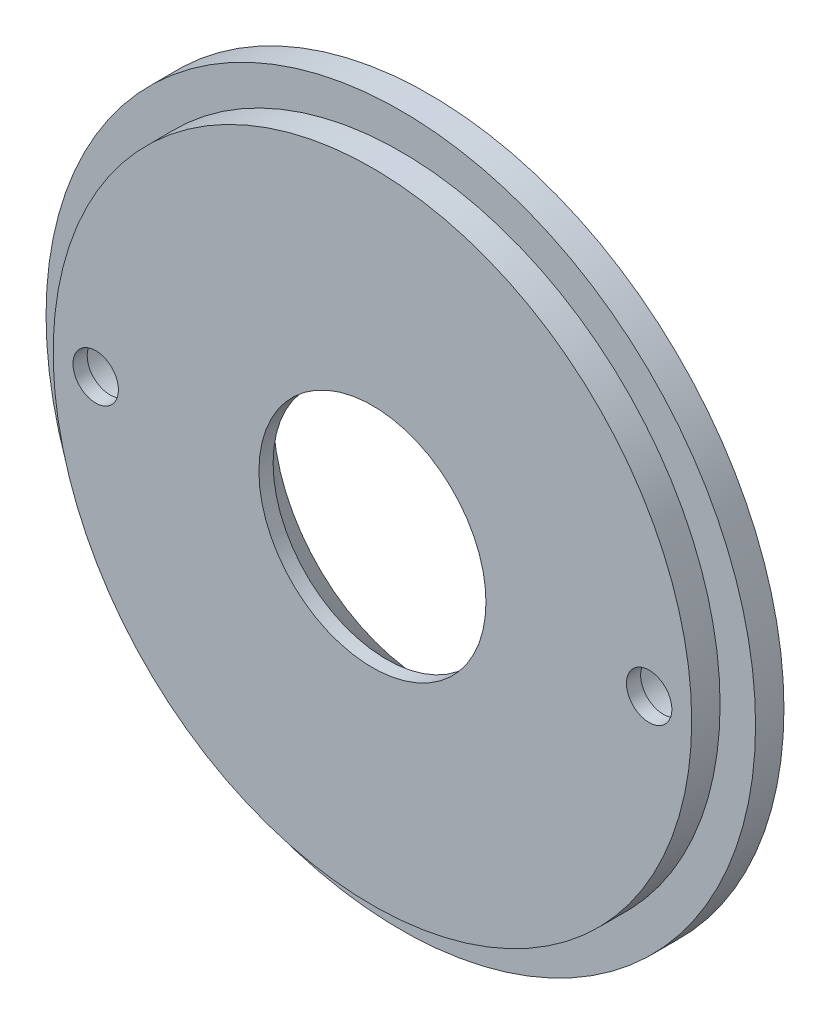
from build123d import *

# Parameters (mm, degrees)
ESQUISSE1_R                                     = 45
BASE_EXTRUSION_DEPTH                            = 4
ESQUISSE2_R                                     = 50
BOSS_EXTRU_1_DEPTH                              = 4
ESQUISSE3_R                                     = 16
ENL_V_MAT_EXTRU_1_DEPTH                         = 14
CHAMBRAGE_POUR_VIS_T_TE_CYLINDRIQUE_D           = 6.4
CHAMBRAGE_POUR_VIS_T_TE_CYLINDRIQUE_CBORE_D     = 11
CHAMBRAGE_POUR_VIS_T_TE_CYLINDRIQUE_CBORE_DEPTH = 6
CHANFREIN1_SIZE                                 = 6


with BuildPart() as part:
    # Esquisse1 → Base-Extrusion (new body)
    with BuildSketch(Plane.XY):
        Circle(ESQUISSE1_R)
    extrude(amount=-BASE_EXTRUSION_DEPTH)

    # Esquisse2 → Boss.-Extru.1 (add)
    with BuildSketch(Plane(origin=(0, 0, -4), x_dir=(-1, 0, 0), z_dir=(0, 0, -1))):
        Circle(ESQUISSE2_R)
    extrude(amount=BOSS_EXTRU_1_DEPTH)

    # Esquisse3 → Enl_v. mat.-Extru.1 (cut)
    with BuildSketch(Plane(origin=(0, 0, -8), x_dir=(-1, 0, 0), z_dir=(0, 0, -1))):
        Circle(ESQUISSE3_R)
    extrude(amount=-ENL_V_MAT_EXTRU_1_DEPTH, mode=Mode.SUBTRACT)

    # Chambrage pour vis _ t_te cylindrique (through all)
    with Locations(Plane(origin=(39, 0, -8), x_dir=(-1, 0, 0), z_dir=(0, 0, -1))):
        with Locations((0, 0), (78, 0)):
            CounterBoreHole(CHAMBRAGE_POUR_VIS_T_TE_CYLINDRIQUE_D / 2, CHAMBRAGE_POUR_VIS_T_TE_CYLINDRIQUE_CBORE_D / 2, CHAMBRAGE_POUR_VIS_T_TE_CYLINDRIQUE_CBORE_DEPTH)

    # Chanfrein1
    chanfrein1_edges = [part.edges().sort_by_distance(p)[0] for p in [
        (16, 0, -8),
    ]]
    chamfer(chanfrein1_edges, length=CHANFREIN1_SIZE)


solid = part.part
